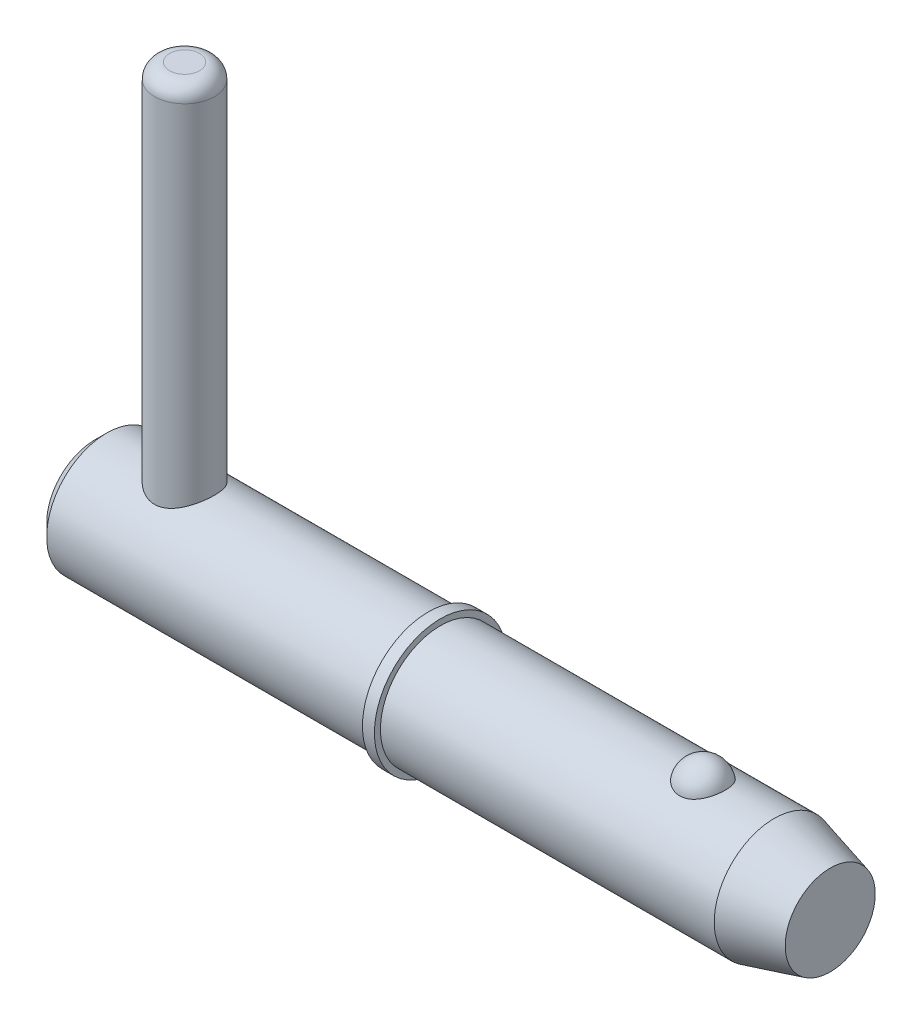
ISO-10303-21;
HEADER;
FILE_DESCRIPTION(('STEP AP214'),'2;1');
FILE_NAME('part.step','',(''),(''),'','','');
FILE_SCHEMA(('AUTOMOTIVE_DESIGN { 1 0 10303 214 1 1 1 1 }'));
ENDSEC;
DATA;
#1=APPLICATION_CONTEXT('core data for automotive mechanical design processes');
#2=APPLICATION_PROTOCOL_DEFINITION('international standard','automotive_design',2000,#1);
#3=PRODUCT_CONTEXT('',#1,'mechanical');
#4=PRODUCT('Part','Part','',(#3));
#5=PRODUCT_RELATED_PRODUCT_CATEGORY('part','',(#4));
#6=PRODUCT_DEFINITION_FORMATION('','',#4);
#7=PRODUCT_DEFINITION_CONTEXT('part definition',#1,'design');
#8=PRODUCT_DEFINITION('design','',#6,#7);
#9=PRODUCT_DEFINITION_SHAPE('','',#8);
#10=(LENGTH_UNIT() NAMED_UNIT(*) SI_UNIT(.MILLI.,.METRE.));
#11=(NAMED_UNIT(*) PLANE_ANGLE_UNIT() SI_UNIT($,.RADIAN.));
#12=(NAMED_UNIT(*) SI_UNIT($,.STERADIAN.) SOLID_ANGLE_UNIT());
#13=UNCERTAINTY_MEASURE_WITH_UNIT(LENGTH_MEASURE(1.E-05),#10,'distance_accuracy_value','');
#14=(GEOMETRIC_REPRESENTATION_CONTEXT(3) GLOBAL_UNCERTAINTY_ASSIGNED_CONTEXT((#13)) GLOBAL_UNIT_ASSIGNED_CONTEXT((#10,
#11,#12)) REPRESENTATION_CONTEXT('',''));
#15=CARTESIAN_POINT('',(0.,0.,0.));
#16=DIRECTION('',(0.,0.,1.));
#17=DIRECTION('',(1.,0.,0.));
#18=AXIS2_PLACEMENT_3D('',#15,#16,#17);
#19=CARTESIAN_POINT('',(4.755,22.225,0.));
#20=DIRECTION('',(0.,-1.,0.));
#21=DIRECTION('',(0.,0.,-1.));
#22=AXIS2_PLACEMENT_3D('',#19,#20,#21);
#23=CYLINDRICAL_SURFACE('',#22,1.585);
#24=CARTESIAN_POINT('',(4.755,-2.3825,0.));
#25=DIRECTION('',(0.,1.,0.));
#26=DIRECTION('',(0.,0.,1.));
#27=AXIS2_PLACEMENT_3D('',#24,#25,#26);
#28=CIRCLE('',#27,1.585);
#29=CARTESIAN_POINT('',(4.755,-2.3825,1.585));
#30=VERTEX_POINT('',#29);
#31=EDGE_CURVE('P0_E25',#30,#30,#28,.T.);
#32=ORIENTED_EDGE('',*,*,#31,.T.);
#33=EDGE_LOOP('',(#32));
#34=FACE_BOUND('',#33,.T.);
#35=CARTESIAN_POINT('',(4.755,21.4325,0.));
#36=DIRECTION('',(0.,1.,0.));
#37=DIRECTION('',(0.,0.,1.));
#38=AXIS2_PLACEMENT_3D('',#35,#36,#37);
#39=CIRCLE('',#38,1.585);
#40=CARTESIAN_POINT('',(4.755,21.4325,1.585));
#41=VERTEX_POINT('',#40);
#42=EDGE_CURVE('P0_E29',#41,#41,#39,.F.);
#43=ORIENTED_EDGE('',*,*,#42,.T.);
#44=EDGE_LOOP('',(#43));
#45=FACE_BOUND('',#44,.T.);
#46=ADVANCED_FACE('P0_F14',(#34,#45),#23,.T.);
#47=CARTESIAN_POINT('',(4.755,22.225,0.));
#48=DIRECTION('',(0.,1.,0.));
#49=DIRECTION('',(0.,0.,1.));
#50=AXIS2_PLACEMENT_3D('',#47,#48,#49);
#51=PLANE('',#50);
#52=CARTESIAN_POINT('',(4.755,22.225,0.));
#53=DIRECTION('',(0.,1.,0.));
#54=DIRECTION('',(0.,0.,1.));
#55=AXIS2_PLACEMENT_3D('',#52,#53,#54);
#56=CIRCLE('',#55,0.7925);
#57=CARTESIAN_POINT('',(4.755,22.225,0.7925));
#58=VERTEX_POINT('',#57);
#59=EDGE_CURVE('P0_E10',#58,#58,#56,.T.);
#60=ORIENTED_EDGE('',*,*,#59,.T.);
#61=EDGE_LOOP('',(#60));
#62=FACE_BOUND('',#61,.T.);
#63=ADVANCED_FACE('P0_F46',(#62),#51,.T.);
#64=CARTESIAN_POINT('',(4.755,-3.175,0.));
#65=DIRECTION('',(0.,1.,0.));
#66=DIRECTION('',(0.,0.,1.));
#67=AXIS2_PLACEMENT_3D('',#64,#65,#66);
#68=PLANE('',#67);
#69=CARTESIAN_POINT('',(4.755,-3.175,0.));
#70=DIRECTION('',(0.,1.,0.));
#71=DIRECTION('',(0.,0.,1.));
#72=AXIS2_PLACEMENT_3D('',#69,#70,#71);
#73=CIRCLE('',#72,0.7925);
#74=CARTESIAN_POINT('',(4.755,-3.175,0.7925));
#75=VERTEX_POINT('',#74);
#76=EDGE_CURVE('P0_E21',#75,#75,#73,.F.);
#77=ORIENTED_EDGE('',*,*,#76,.T.);
#78=EDGE_LOOP('',(#77));
#79=FACE_BOUND('',#78,.T.);
#80=ADVANCED_FACE('P0_F43',(#79),#68,.F.);
#81=CARTESIAN_POINT('',(4.755,-2.3825,0.));
#82=DIRECTION('',(0.,1.,0.));
#83=DIRECTION('',(0.,0.,1.));
#84=AXIS2_PLACEMENT_3D('',#81,#82,#83);
#85=DEGENERATE_TOROIDAL_SURFACE('',#84,0.7925,0.7925,.T.);
#86=ORIENTED_EDGE('',*,*,#76,.F.);
#87=EDGE_LOOP('',(#86));
#88=FACE_BOUND('',#87,.T.);
#89=ORIENTED_EDGE('',*,*,#31,.F.);
#90=EDGE_LOOP('',(#89));
#91=FACE_BOUND('',#90,.T.);
#92=ADVANCED_FACE('P0_F38',(#88,#91),#85,.T.);
#93=CARTESIAN_POINT('',(4.755,21.4325,0.));
#94=DIRECTION('',(0.,1.,0.));
#95=DIRECTION('',(0.,0.,1.));
#96=AXIS2_PLACEMENT_3D('',#93,#94,#95);
#97=DEGENERATE_TOROIDAL_SURFACE('',#96,0.7925,0.7925,.T.);
#98=ORIENTED_EDGE('',*,*,#42,.F.);
#99=EDGE_LOOP('',(#98));
#100=FACE_BOUND('',#99,.T.);
#101=ORIENTED_EDGE('',*,*,#59,.F.);
#102=EDGE_LOOP('',(#101));
#103=FACE_BOUND('',#102,.T.);
#104=ADVANCED_FACE('P0_F16',(#100,#103),#97,.T.);
#105=CLOSED_SHELL('',(#46,#63,#80,#92,#104));
#106=MANIFOLD_SOLID_BREP('P0_B1',#105);
#107=CARTESIAN_POINT('',(0.,0.,0.));
#108=DIRECTION('',(1.,0.,0.));
#109=DIRECTION('',(0.,0.,-1.));
#110=AXIS2_PLACEMENT_3D('',#107,#108,#109);
#111=CYLINDRICAL_SURFACE('',#110,3.175);
#112=CARTESIAN_POINT('',(35.9476846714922,0.,0.));
#113=DIRECTION('',(1.,0.,0.));
#114=DIRECTION('',(0.,0.,-1.));
#115=AXIS2_PLACEMENT_3D('',#112,#113,#114);
#116=CIRCLE('',#115,3.175);
#117=CARTESIAN_POINT('',(35.9476846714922,0.,-3.175));
#118=VERTEX_POINT('',#117);
#119=EDGE_CURVE('P1_E81',#118,#118,#116,.T.);
#120=ORIENTED_EDGE('',*,*,#119,.F.);
#121=EDGE_LOOP('',(#120));
#122=FACE_BOUND('',#121,.T.);
#123=CARTESIAN_POINT('',(18.29,0.,0.));
#124=DIRECTION('',(1.,0.,0.));
#125=DIRECTION('',(0.,0.,-1.));
#126=AXIS2_PLACEMENT_3D('',#123,#124,#125);
#127=CIRCLE('',#126,3.175);
#128=CARTESIAN_POINT('',(18.29,0.,-3.175));
#129=VERTEX_POINT('',#128);
#130=EDGE_CURVE('P1_E85',#129,#129,#127,.T.);
#131=ORIENTED_EDGE('',*,*,#130,.T.);
#132=EDGE_LOOP('',(#131));
#133=FACE_BOUND('',#132,.T.);
#134=CARTESIAN_POINT('',(32.1757276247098,2.92898950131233,1.2254164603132));
#135=CARTESIAN_POINT('',(32.112316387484,2.92899434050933,1.22541146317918));
#136=CARTESIAN_POINT('',(32.0487979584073,2.93112688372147,1.2203464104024));
#137=CARTESIAN_POINT('',(31.9235306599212,2.93942752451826,1.20020949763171));
#138=CARTESIAN_POINT('',(31.8617869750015,2.9456063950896,1.18511092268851));
#139=CARTESIAN_POINT('',(31.7420651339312,2.96127115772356,1.14540352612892));
#140=CARTESIAN_POINT('',(31.6840775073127,2.97074831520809,1.12081980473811));
#141=CARTESIAN_POINT('',(31.5731943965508,2.99197584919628,1.06285154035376));
#142=CARTESIAN_POINT('',(31.5202966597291,3.0037252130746,1.0294709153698));
#143=CARTESIAN_POINT('',(31.4192688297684,3.02865714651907,0.95367409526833));
#144=CARTESIAN_POINT('',(31.371324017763,3.04187163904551,0.911021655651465));
#145=CARTESIAN_POINT('',(31.2830360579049,3.06808741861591,0.818400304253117));
#146=CARTESIAN_POINT('',(31.2426952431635,3.08108863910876,0.768429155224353));
#147=CARTESIAN_POINT('',(31.1688039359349,3.10614903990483,0.660064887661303));
#148=CARTESIAN_POINT('',(31.1356330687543,3.11814104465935,0.601396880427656));
#149=CARTESIAN_POINT('',(31.0791190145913,3.13926931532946,0.479026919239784));
#150=CARTESIAN_POINT('',(31.0557764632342,3.14840539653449,0.415324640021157));
#151=CARTESIAN_POINT('',(31.0191785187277,3.16298160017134,0.283885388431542));
#152=CARTESIAN_POINT('',(31.0060407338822,3.16837855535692,0.216110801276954));
#153=CARTESIAN_POINT('',(30.9905676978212,3.17475386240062,0.0791367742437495));
#154=CARTESIAN_POINT('',(30.988232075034,3.17573236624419,0.00993738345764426));
#155=CARTESIAN_POINT('',(30.994388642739,3.17318075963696,-0.127420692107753));
#156=CARTESIAN_POINT('',(31.0028073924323,3.16968122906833,-0.195583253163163));
#157=CARTESIAN_POINT('',(31.0301752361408,3.1585790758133,-0.329413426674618));
#158=CARTESIAN_POINT('',(31.0491245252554,3.15097637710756,-0.395080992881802));
#159=CARTESIAN_POINT('',(31.0972057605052,3.13242485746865,-0.522180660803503));
#160=CARTESIAN_POINT('',(31.1263524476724,3.12147119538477,-0.583606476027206));
#161=CARTESIAN_POINT('',(31.1942352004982,3.09734973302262,-0.700436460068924));
#162=CARTESIAN_POINT('',(31.232972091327,3.08418174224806,-0.755840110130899));
#163=CARTESIAN_POINT('',(31.3194771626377,3.05694884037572,-0.859404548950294));
#164=CARTESIAN_POINT('',(31.3672961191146,3.04287919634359,-0.907521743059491));
#165=CARTESIAN_POINT('',(31.4707353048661,3.01548927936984,-0.994758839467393));
#166=CARTESIAN_POINT('',(31.5263549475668,3.00216895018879,-1.03387941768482));
#167=CARTESIAN_POINT('',(31.6428093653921,2.97810316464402,-1.10126594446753));
#168=CARTESIAN_POINT('',(31.7035182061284,2.96731170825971,-1.12973256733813));
#169=CARTESIAN_POINT('',(31.8293712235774,2.9492893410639,-1.17598467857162));
#170=CARTESIAN_POINT('',(31.8945137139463,2.94205708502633,-1.19377420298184));
#171=CARTESIAN_POINT('',(32.0238562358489,2.93233065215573,-1.21746387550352));
#172=CARTESIAN_POINT('',(32.0879385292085,2.92961621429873,-1.22391763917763));
#173=CARTESIAN_POINT('',(32.2163375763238,2.92855752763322,-1.22644976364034));
#174=CARTESIAN_POINT('',(32.2806542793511,2.93021238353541,-1.22253024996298));
#175=CARTESIAN_POINT('',(32.4055239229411,2.9375685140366,-1.20474140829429));
#176=CARTESIAN_POINT('',(32.466131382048,2.94313790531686,-1.19119621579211));
#177=CARTESIAN_POINT('',(32.5841106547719,2.95756226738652,-1.15491492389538));
#178=CARTESIAN_POINT('',(32.6414822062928,2.96641750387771,-1.13217808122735));
#179=CARTESIAN_POINT('',(32.7527699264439,2.98669918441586,-1.07755083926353));
#180=CARTESIAN_POINT('',(32.8065845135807,2.9981771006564,-1.0454730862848));
#181=CARTESIAN_POINT('',(32.9081473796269,3.02240235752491,-0.973220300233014));
#182=CARTESIAN_POINT('',(32.9558942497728,3.03514999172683,-0.933043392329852));
#183=CARTESIAN_POINT('',(33.0465817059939,3.06131230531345,-0.843372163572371));
#184=CARTESIAN_POINT('',(33.0891588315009,3.07472822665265,-0.793510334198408));
#185=CARTESIAN_POINT('',(33.1656765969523,3.10021106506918,-0.687241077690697));
#186=CARTESIAN_POINT('',(33.1996156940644,3.1122777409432,-0.630832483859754));
#187=CARTESIAN_POINT('',(33.2591209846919,3.134208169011,-0.511059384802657));
#188=CARTESIAN_POINT('',(33.2843892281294,3.14399040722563,-0.447531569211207));
#189=CARTESIAN_POINT('',(33.3245117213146,3.15983820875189,-0.316827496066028));
#190=CARTESIAN_POINT('',(33.3393659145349,3.16590375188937,-0.249651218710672));
#191=CARTESIAN_POINT('',(33.358358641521,3.17370076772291,-0.11354918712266));
#192=CARTESIAN_POINT('',(33.3624966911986,3.17543204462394,-0.0446233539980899));
#193=CARTESIAN_POINT('',(33.3599697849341,3.17438372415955,0.0929938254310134));
#194=CARTESIAN_POINT('',(33.3533050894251,3.17160423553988,0.161685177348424));
#195=CARTESIAN_POINT('',(33.3293754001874,3.1618438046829,0.296502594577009));
#196=CARTESIAN_POINT('',(33.3121674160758,3.15488546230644,0.362640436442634));
#197=CARTESIAN_POINT('',(33.267547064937,3.13748892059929,0.490896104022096));
#198=CARTESIAN_POINT('',(33.2401339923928,3.12705048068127,0.553013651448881));
#199=CARTESIAN_POINT('',(33.1754626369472,3.10369139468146,0.671876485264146));
#200=CARTESIAN_POINT('',(33.1381467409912,3.0907563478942,0.728587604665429));
#201=CARTESIAN_POINT('',(33.0545246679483,3.06381731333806,0.834653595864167));
#202=CARTESIAN_POINT('',(33.0082189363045,3.04981337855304,0.884008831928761));
#203=CARTESIAN_POINT('',(32.9077184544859,3.02230423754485,0.973916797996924));
#204=CARTESIAN_POINT('',(32.853535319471,3.00879833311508,1.01448227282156));
#205=CARTESIAN_POINT('',(32.7385299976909,2.98383625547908,1.0857155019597));
#206=CARTESIAN_POINT('',(32.6777053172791,2.9723808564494,1.11637952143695));
#207=CARTESIAN_POINT('',(32.5533690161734,2.95329063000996,1.16592590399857));
#208=CARTESIAN_POINT('',(32.4900230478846,2.9455373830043,1.18517901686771));
#209=CARTESIAN_POINT('',(32.3607664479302,2.9342556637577,1.21284802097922));
#210=CARTESIAN_POINT('',(32.2948641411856,2.93071450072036,1.2212964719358));
#211=CARTESIAN_POINT('',(32.211116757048,2.9291525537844,1.22502505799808));
#212=CARTESIAN_POINT('',(32.1934263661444,2.92898815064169,1.22541785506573));
#213=CARTESIAN_POINT('',(32.1757276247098,2.92898950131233,1.2254164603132));
#214=B_SPLINE_CURVE_WITH_KNOTS('',3,(#134,#135,#136,#137,#138,#139,#140,#141,#142,#143,#144,
#145,#146,#147,#148,#149,#150,#151,#152,#153,#154,#155,#156,#157,#158,#159,#160,#161,#162,#163,
#164,#165,#166,#167,#168,#169,#170,#171,#172,#173,#174,#175,#176,#177,#178,#179,#180,#181,#182,
#183,#184,#185,#186,#187,#188,#189,#190,#191,#192,#193,#194,#195,#196,#197,#198,#199,#200,#201,
#202,#203,#204,#205,#206,#207,#208,#209,#210,#211,#212,#213),.UNSPECIFIED.,.T.,.F.,(4,2,2,2,2,2,
2,2,2,2,2,2,2,2,2,2,2,2,2,2,2,2,2,2,2,2,2,2,2,2,2,2,2,2,2,2,2,2,2,4),(0.,0.190186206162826,
0.380880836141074,0.571074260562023,0.761183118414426,0.956866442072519,1.1526097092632,
1.3570177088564,1.56143892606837,1.76818248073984,1.97491892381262,2.18025109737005,
2.38558707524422,2.59122111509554,2.79687285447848,3.00371012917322,3.2105318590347,
3.41323429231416,3.61586005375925,3.80828192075,4.00066436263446,4.18685798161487,
4.37306665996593,4.56330302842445,4.75358348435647,4.95345287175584,5.15335793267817,
5.35957003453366,5.56578325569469,5.77200579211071,5.97822335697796,6.183335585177,
6.38846199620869,6.59480900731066,6.80114579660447,7.00718137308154,7.21329457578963,
7.41228022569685,7.61066481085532,7.66374777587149),.UNSPECIFIED.);
#215=CARTESIAN_POINT('',(32.1757276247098,2.92898950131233,1.2254164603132));
#216=VERTEX_POINT('',#215);
#217=EDGE_CURVE('P1_E35',#216,#216,#214,.T.);
#218=ORIENTED_EDGE('',*,*,#217,.T.);
#219=EDGE_LOOP('',(#218));
#220=FACE_BOUND('',#219,.T.);
#221=ADVANCED_FACE('P1_F13',(#122,#133,#220),#111,.T.);
#222=CARTESIAN_POINT('',(0.,0.,0.));
#223=DIRECTION('',(-1.,0.,0.));
#224=DIRECTION('',(0.,0.,1.));
#225=AXIS2_PLACEMENT_3D('',#222,#223,#224);
#226=PLANE('',#225);
#227=CARTESIAN_POINT('',(0.,0.,0.));
#228=DIRECTION('',(1.,0.,0.));
#229=DIRECTION('',(0.,0.,-1.));
#230=AXIS2_PLACEMENT_3D('',#227,#228,#229);
#231=CIRCLE('',#230,2.54);
#232=CARTESIAN_POINT('',(0.,0.,-2.54));
#233=VERTEX_POINT('',#232);
#234=EDGE_CURVE('P1_E9',#233,#233,#231,.T.);
#235=ORIENTED_EDGE('',*,*,#234,.F.);
#236=EDGE_LOOP('',(#235));
#237=FACE_BOUND('',#236,.T.);
#238=ADVANCED_FACE('P1_F15',(#237),#226,.T.);
#239=CARTESIAN_POINT('',(0.634999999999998,0.,0.));
#240=DIRECTION('',(1.,0.,0.));
#241=DIRECTION('',(0.,0.,-1.));
#242=AXIS2_PLACEMENT_3D('',#239,#240,#241);
#243=CONICAL_SURFACE('',#242,3.175,0.78539816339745);
#244=ORIENTED_EDGE('',*,*,#234,.T.);
#245=EDGE_LOOP('',(#244));
#246=FACE_BOUND('',#245,.T.);
#247=CARTESIAN_POINT('',(0.634999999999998,0.,0.));
#248=DIRECTION('',(1.,0.,0.));
#249=DIRECTION('',(0.,0.,-1.));
#250=AXIS2_PLACEMENT_3D('',#247,#248,#249);
#251=CIRCLE('',#250,3.175);
#252=CARTESIAN_POINT('',(0.634999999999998,0.,-3.175));
#253=VERTEX_POINT('',#252);
#254=EDGE_CURVE('P1_E26',#253,#253,#251,.T.);
#255=ORIENTED_EDGE('',*,*,#254,.F.);
#256=EDGE_LOOP('',(#255));
#257=FACE_BOUND('',#256,.T.);
#258=ADVANCED_FACE('P1_F77',(#246,#257),#243,.T.);
#259=CARTESIAN_POINT('',(0.,0.,0.));
#260=DIRECTION('',(1.,0.,0.));
#261=DIRECTION('',(0.,0.,-1.));
#262=AXIS2_PLACEMENT_3D('',#259,#260,#261);
#263=CYLINDRICAL_SURFACE('',#262,3.175);
#264=CARTESIAN_POINT('',(4.755,-2.75107251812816,1.585));
#265=CARTESIAN_POINT('',(4.67238891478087,-2.7510796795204,1.58499425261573));
#266=CARTESIAN_POINT('',(4.58967306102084,-2.75485010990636,1.57849830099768));
#267=CARTESIAN_POINT('',(4.42677850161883,-2.76938647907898,1.55284486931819));
#268=CARTESIAN_POINT('',(4.34660551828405,-2.78016716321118,1.53366069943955));
#269=CARTESIAN_POINT('',(4.19146029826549,-2.80716278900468,1.48366329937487));
#270=CARTESIAN_POINT('',(4.11646293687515,-2.8233488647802,1.45291173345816));
#271=CARTESIAN_POINT('',(3.97271079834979,-2.85928672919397,1.38084067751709));
#272=CARTESIAN_POINT('',(3.90395634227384,-2.87903870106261,1.33952064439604));
#273=CARTESIAN_POINT('',(3.76839976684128,-2.921867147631,1.24350234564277));
#274=CARTESIAN_POINT('',(3.702222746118,-2.94508343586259,1.18798355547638));
#275=CARTESIAN_POINT('',(3.5796334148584,-2.99109588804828,1.06685014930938));
#276=CARTESIAN_POINT('',(3.52322596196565,-3.01389183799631,1.00123054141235));
#277=CARTESIAN_POINT('',(3.41807024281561,-3.05832598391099,0.856373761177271));
#278=CARTESIAN_POINT('',(3.37009053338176,-3.07978367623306,0.776518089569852));
#279=CARTESIAN_POINT('',(3.28853137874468,-3.11730894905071,0.608596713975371));
#280=CARTESIAN_POINT('',(3.25494287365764,-3.1333799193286,0.520536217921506));
#281=CARTESIAN_POINT('',(3.20559401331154,-3.15731341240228,0.345327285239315));
#282=CARTESIAN_POINT('',(3.18873760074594,-3.16567752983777,0.258557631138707));
#283=CARTESIAN_POINT('',(3.16972238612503,-3.17512718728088,0.0830496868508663));
#284=CARTESIAN_POINT('',(3.16755472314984,-3.17621711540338,-0.00568738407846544));
#285=CARTESIAN_POINT('',(3.1775542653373,-3.17123385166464,-0.174372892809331));
#286=CARTESIAN_POINT('',(3.18849502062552,-3.16577346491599,-0.254416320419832));
#287=CARTESIAN_POINT('',(3.22220680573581,-3.14922844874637,-0.411354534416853));
#288=CARTESIAN_POINT('',(3.2449787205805,-3.13814339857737,-0.488249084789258));
#289=CARTESIAN_POINT('',(3.30185558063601,-3.111172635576,-0.638050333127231));
#290=CARTESIAN_POINT('',(3.33611332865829,-3.09522247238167,-0.710886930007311));
#291=CARTESIAN_POINT('',(3.41477890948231,-3.05996035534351,-0.849953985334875));
#292=CARTESIAN_POINT('',(3.45919037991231,-3.04064719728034,-0.916182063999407));
#293=CARTESIAN_POINT('',(3.5617148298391,-2.99832415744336,-1.04681642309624));
#294=CARTESIAN_POINT('',(3.62072497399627,-2.97513741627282,-1.11046186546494));
#295=CARTESIAN_POINT('',(3.7483697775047,-2.92885066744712,-1.22736291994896));
#296=CARTESIAN_POINT('',(3.81701173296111,-2.90575073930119,-1.2806105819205));
#297=CARTESIAN_POINT('',(3.96727993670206,-2.86067370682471,-1.37849835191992));
#298=CARTESIAN_POINT('',(4.04945242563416,-2.83885964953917,-1.42238246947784));
#299=CARTESIAN_POINT('',(4.2213558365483,-2.80110454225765,-1.49537418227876));
#300=CARTESIAN_POINT('',(4.3110787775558,-2.78515738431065,-1.52449715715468));
#301=CARTESIAN_POINT('',(4.48806324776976,-2.76271292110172,-1.56478065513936));
#302=CARTESIAN_POINT('',(4.57495732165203,-2.75556745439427,-1.57718067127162));
#303=CARTESIAN_POINT('',(4.74985771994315,-2.74969306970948,-1.58740564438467));
#304=CARTESIAN_POINT('',(4.8378632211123,-2.75095824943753,-1.58524082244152));
#305=CARTESIAN_POINT('',(5.00227282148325,-2.76107477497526,-1.56753530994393));
#306=CARTESIAN_POINT('',(5.07889680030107,-2.76908515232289,-1.55347662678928));
#307=CARTESIAN_POINT('',(5.22855309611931,-2.79054849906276,-1.51458035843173));
#308=CARTESIAN_POINT('',(5.30158424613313,-2.80400322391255,-1.489739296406));
#309=CARTESIAN_POINT('',(5.44583114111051,-2.83556995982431,-1.42877335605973));
#310=CARTESIAN_POINT('',(5.51680600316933,-2.85386886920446,-1.39217900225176));
#311=CARTESIAN_POINT('',(5.6520174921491,-2.89289503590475,-1.30915485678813));
#312=CARTESIAN_POINT('',(5.71625063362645,-2.91362353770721,-1.26272001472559));
#313=CARTESIAN_POINT('',(5.8445938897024,-2.95830220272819,-1.15451693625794));
#314=CARTESIAN_POINT('',(5.90767560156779,-2.98233004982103,-1.09155543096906));
#315=CARTESIAN_POINT('',(6.0226995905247,-3.02864458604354,-0.955560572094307));
#316=CARTESIAN_POINT('',(6.07463814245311,-3.05093069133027,-0.882523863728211));
#317=CARTESIAN_POINT('',(6.16704288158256,-3.09200671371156,-0.725836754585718));
#318=CARTESIAN_POINT('',(6.20717458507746,-3.11069030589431,-0.64195924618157));
#319=CARTESIAN_POINT('',(6.27235859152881,-3.1416474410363,-0.467442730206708));
#320=CARTESIAN_POINT('',(6.29742409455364,-3.15392659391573,-0.376809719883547));
#321=CARTESIAN_POINT('',(6.32960989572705,-3.16979844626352,-0.200314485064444));
#322=CARTESIAN_POINT('',(6.33816324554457,-3.17408359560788,-0.114775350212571));
#323=CARTESIAN_POINT('',(6.34130309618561,-3.17565001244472,0.0566108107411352));
#324=CARTESIAN_POINT('',(6.33589445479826,-3.17293371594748,0.142457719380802));
#325=CARTESIAN_POINT('',(6.31221457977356,-3.16120608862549,0.306097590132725));
#326=CARTESIAN_POINT('',(6.2948097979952,-3.15261910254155,0.38404960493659));
#327=CARTESIAN_POINT('',(6.24879775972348,-3.13040364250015,0.535801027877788));
#328=CARTESIAN_POINT('',(6.22018889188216,-3.11677444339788,0.609599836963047));
#329=CARTESIAN_POINT('',(6.15130303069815,-3.08497808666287,0.754502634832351));
#330=CARTESIAN_POINT('',(6.11057850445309,-3.0666414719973,0.82535556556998));
#331=CARTESIAN_POINT('',(6.01917980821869,-3.02735012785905,0.95951596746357));
#332=CARTESIAN_POINT('',(5.96850106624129,-3.00639419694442,1.02281994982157));
#333=CARTESIAN_POINT('',(5.8528006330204,-2.96149402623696,1.1467073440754));
#334=CARTESIAN_POINT('',(5.78685463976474,-2.93745961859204,1.20639723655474));
#335=CARTESIAN_POINT('',(5.64552278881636,-2.89084502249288,1.31419099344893));
#336=CARTESIAN_POINT('',(5.57012871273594,-2.8682661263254,1.36228466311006));
#337=CARTESIAN_POINT('',(5.40892145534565,-2.82661780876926,1.44677201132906));
#338=CARTESIAN_POINT('',(5.32285703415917,-2.80767948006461,1.48275497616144));
#339=CARTESIAN_POINT('',(5.14469010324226,-2.77716572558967,1.53916557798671));
#340=CARTESIAN_POINT('',(5.05260892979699,-2.76556569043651,1.55964525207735));
#341=CARTESIAN_POINT('',(4.92544162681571,-2.75613775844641,1.57618070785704));
#342=CARTESIAN_POINT('',(4.89147210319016,-2.75424493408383,1.57948285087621));
#343=CARTESIAN_POINT('',(4.82334103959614,-2.75171079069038,1.58389375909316));
#344=CARTESIAN_POINT('',(4.78917948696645,-2.75106955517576,1.58500237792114));
#345=CARTESIAN_POINT('',(4.755,-2.75107251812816,1.585));
#346=B_SPLINE_CURVE_WITH_KNOTS('',3,(#264,#265,#266,#267,#268,#269,#270,#271,#272,#273,#274,
#275,#276,#277,#278,#279,#280,#281,#282,#283,#284,#285,#286,#287,#288,#289,#290,#291,#292,#293,
#294,#295,#296,#297,#298,#299,#300,#301,#302,#303,#304,#305,#306,#307,#308,#309,#310,#311,#312,
#313,#314,#315,#316,#317,#318,#319,#320,#321,#322,#323,#324,#325,#326,#327,#328,#329,#330,#331,
#332,#333,#334,#335,#336,#337,#338,#339,#340,#341,#342,#343,#344,#345),.UNSPECIFIED.,.T.,.F.,(4,
2,2,2,2,2,2,2,2,2,2,2,2,2,2,2,2,2,2,2,2,2,2,2,2,2,2,2,2,2,2,2,2,2,2,2,2,2,2,2,4),(0.,
0.247689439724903,0.495901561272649,0.742808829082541,0.989728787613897,1.25694656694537,
1.52429683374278,1.80959781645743,2.0947189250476,2.35960564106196,2.62433255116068,
2.86610932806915,3.1079041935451,3.35305262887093,3.59828902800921,3.86665310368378,
4.13522157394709,4.4207514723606,4.70598326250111,4.9686344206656,5.23110127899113,
5.46499114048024,5.69895647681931,5.94376186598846,6.1886932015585,6.46438263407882,
6.74016408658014,7.0231370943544,7.30586181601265,7.5626977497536,7.81944433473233,
8.05935987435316,8.29930993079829,8.54954401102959,8.79989329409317,9.07508848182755,
9.35052473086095,9.63453318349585,9.91758407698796,10.0200561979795,10.1225351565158),.UNSPECIFIED.);
#347=CARTESIAN_POINT('',(4.755,-2.75107251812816,1.585));
#348=VERTEX_POINT('',#347);
#349=EDGE_CURVE('P1_E17',#348,#348,#346,.T.);
#350=ORIENTED_EDGE('',*,*,#349,.F.);
#351=EDGE_LOOP('',(#350));
#352=FACE_BOUND('',#351,.T.);
#353=CARTESIAN_POINT('',(4.755,2.75107251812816,1.585));
#354=CARTESIAN_POINT('',(4.83761108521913,2.7510796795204,1.58499425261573));
#355=CARTESIAN_POINT('',(4.92032693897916,2.75485010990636,1.57849830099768));
#356=CARTESIAN_POINT('',(5.08322149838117,2.76938647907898,1.55284486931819));
#357=CARTESIAN_POINT('',(5.16339448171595,2.78016716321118,1.53366069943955));
#358=CARTESIAN_POINT('',(5.31853970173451,2.80716278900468,1.48366329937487));
#359=CARTESIAN_POINT('',(5.39353706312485,2.8233488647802,1.45291173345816));
#360=CARTESIAN_POINT('',(5.53728920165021,2.85928672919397,1.38084067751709));
#361=CARTESIAN_POINT('',(5.60604365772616,2.87903870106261,1.33952064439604));
#362=CARTESIAN_POINT('',(5.74160023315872,2.921867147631,1.24350234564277));
#363=CARTESIAN_POINT('',(5.807777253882,2.94508343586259,1.18798355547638));
#364=CARTESIAN_POINT('',(5.9303665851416,2.99109588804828,1.06685014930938));
#365=CARTESIAN_POINT('',(5.98677403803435,3.01389183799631,1.00123054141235));
#366=CARTESIAN_POINT('',(6.09192975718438,3.05832598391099,0.85637376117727));
#367=CARTESIAN_POINT('',(6.13990946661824,3.07978367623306,0.776518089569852));
#368=CARTESIAN_POINT('',(6.22146862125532,3.11730894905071,0.608596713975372));
#369=CARTESIAN_POINT('',(6.25505712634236,3.1333799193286,0.520536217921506));
#370=CARTESIAN_POINT('',(6.30440598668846,3.15731341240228,0.345327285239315));
#371=CARTESIAN_POINT('',(6.32126239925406,3.16567752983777,0.258557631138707));
#372=CARTESIAN_POINT('',(6.34027761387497,3.17512718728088,0.0830496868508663));
#373=CARTESIAN_POINT('',(6.34244527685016,3.17621711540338,-0.00568738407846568));
#374=CARTESIAN_POINT('',(6.3324457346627,3.17123385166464,-0.174372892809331));
#375=CARTESIAN_POINT('',(6.32150497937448,3.16577346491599,-0.254416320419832));
#376=CARTESIAN_POINT('',(6.28779319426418,3.14922844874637,-0.411354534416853));
#377=CARTESIAN_POINT('',(6.2650212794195,3.13814339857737,-0.488249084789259));
#378=CARTESIAN_POINT('',(6.20814441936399,3.111172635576,-0.638050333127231));
#379=CARTESIAN_POINT('',(6.17388667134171,3.09522247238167,-0.710886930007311));
#380=CARTESIAN_POINT('',(6.09522109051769,3.05996035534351,-0.849953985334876));
#381=CARTESIAN_POINT('',(6.05080962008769,3.04064719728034,-0.916182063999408));
#382=CARTESIAN_POINT('',(5.9482851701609,2.99832415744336,-1.04681642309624));
#383=CARTESIAN_POINT('',(5.88927502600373,2.97513741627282,-1.11046186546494));
#384=CARTESIAN_POINT('',(5.7616302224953,2.92885066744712,-1.22736291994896));
#385=CARTESIAN_POINT('',(5.69298826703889,2.90575073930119,-1.2806105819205));
#386=CARTESIAN_POINT('',(5.54272006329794,2.86067370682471,-1.37849835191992));
#387=CARTESIAN_POINT('',(5.46054757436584,2.83885964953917,-1.42238246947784));
#388=CARTESIAN_POINT('',(5.2886441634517,2.80110454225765,-1.49537418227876));
#389=CARTESIAN_POINT('',(5.19892122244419,2.78515738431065,-1.52449715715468));
#390=CARTESIAN_POINT('',(5.02193675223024,2.76271292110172,-1.56478065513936));
#391=CARTESIAN_POINT('',(4.93504267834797,2.75556745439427,-1.57718067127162));
#392=CARTESIAN_POINT('',(4.76014228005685,2.74969306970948,-1.58740564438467));
#393=CARTESIAN_POINT('',(4.6721367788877,2.75095824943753,-1.58524082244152));
#394=CARTESIAN_POINT('',(4.50772717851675,2.76107477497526,-1.56753530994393));
#395=CARTESIAN_POINT('',(4.43110319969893,2.76908515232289,-1.55347662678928));
#396=CARTESIAN_POINT('',(4.28144690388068,2.79054849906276,-1.51458035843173));
#397=CARTESIAN_POINT('',(4.20841575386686,2.80400322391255,-1.489739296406));
#398=CARTESIAN_POINT('',(4.06416885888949,2.83556995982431,-1.42877335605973));
#399=CARTESIAN_POINT('',(3.99319399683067,2.85386886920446,-1.39217900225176));
#400=CARTESIAN_POINT('',(3.8579825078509,2.89289503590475,-1.30915485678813));
#401=CARTESIAN_POINT('',(3.79374936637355,2.91362353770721,-1.26272001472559));
#402=CARTESIAN_POINT('',(3.6654061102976,2.95830220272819,-1.15451693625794));
#403=CARTESIAN_POINT('',(3.60232439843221,2.98233004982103,-1.09155543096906));
#404=CARTESIAN_POINT('',(3.4873004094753,3.02864458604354,-0.955560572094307));
#405=CARTESIAN_POINT('',(3.43536185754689,3.05093069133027,-0.88252386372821));
#406=CARTESIAN_POINT('',(3.34295711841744,3.09200671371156,-0.725836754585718));
#407=CARTESIAN_POINT('',(3.30282541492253,3.11069030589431,-0.64195924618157));
#408=CARTESIAN_POINT('',(3.23764140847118,3.14164744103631,-0.467442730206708));
#409=CARTESIAN_POINT('',(3.21257590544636,3.15392659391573,-0.376809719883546));
#410=CARTESIAN_POINT('',(3.18039010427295,3.16979844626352,-0.200314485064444));
#411=CARTESIAN_POINT('',(3.17183675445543,3.17408359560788,-0.114775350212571));
#412=CARTESIAN_POINT('',(3.16869690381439,3.17565001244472,0.0566108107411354));
#413=CARTESIAN_POINT('',(3.17410554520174,3.17293371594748,0.142457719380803));
#414=CARTESIAN_POINT('',(3.19778542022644,3.16120608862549,0.306097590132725));
#415=CARTESIAN_POINT('',(3.2151902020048,3.15261910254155,0.384049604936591));
#416=CARTESIAN_POINT('',(3.26120224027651,3.13040364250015,0.535801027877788));
#417=CARTESIAN_POINT('',(3.28981110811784,3.11677444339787,0.609599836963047));
#418=CARTESIAN_POINT('',(3.35869696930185,3.08497808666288,0.754502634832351));
#419=CARTESIAN_POINT('',(3.39942149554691,3.0666414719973,0.82535556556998));
#420=CARTESIAN_POINT('',(3.49082019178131,3.02735012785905,0.95951596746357));
#421=CARTESIAN_POINT('',(3.54149893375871,3.00639419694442,1.02281994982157));
#422=CARTESIAN_POINT('',(3.6571993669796,2.96149402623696,1.1467073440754));
#423=CARTESIAN_POINT('',(3.72314536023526,2.93745961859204,1.20639723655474));
#424=CARTESIAN_POINT('',(3.86447721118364,2.89084502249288,1.31419099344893));
#425=CARTESIAN_POINT('',(3.93987128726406,2.8682661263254,1.36228466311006));
#426=CARTESIAN_POINT('',(4.10107854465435,2.82661780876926,1.44677201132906));
#427=CARTESIAN_POINT('',(4.18714296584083,2.80767948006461,1.48275497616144));
#428=CARTESIAN_POINT('',(4.36530989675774,2.77716572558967,1.53916557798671));
#429=CARTESIAN_POINT('',(4.45739107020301,2.76556569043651,1.55964525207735));
#430=CARTESIAN_POINT('',(4.58455837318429,2.75613775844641,1.57618070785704));
#431=CARTESIAN_POINT('',(4.61852789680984,2.75424493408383,1.57948285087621));
#432=CARTESIAN_POINT('',(4.68665896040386,2.75171079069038,1.58389375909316));
#433=CARTESIAN_POINT('',(4.72082051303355,2.75106955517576,1.58500237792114));
#434=CARTESIAN_POINT('',(4.755,2.75107251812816,1.585));
#435=B_SPLINE_CURVE_WITH_KNOTS('',3,(#353,#354,#355,#356,#357,#358,#359,#360,#361,#362,#363,
#364,#365,#366,#367,#368,#369,#370,#371,#372,#373,#374,#375,#376,#377,#378,#379,#380,#381,#382,
#383,#384,#385,#386,#387,#388,#389,#390,#391,#392,#393,#394,#395,#396,#397,#398,#399,#400,#401,
#402,#403,#404,#405,#406,#407,#408,#409,#410,#411,#412,#413,#414,#415,#416,#417,#418,#419,#420,
#421,#422,#423,#424,#425,#426,#427,#428,#429,#430,#431,#432,#433,#434),.UNSPECIFIED.,.T.,.F.,(4,
2,2,2,2,2,2,2,2,2,2,2,2,2,2,2,2,2,2,2,2,2,2,2,2,2,2,2,2,2,2,2,2,2,2,2,2,2,2,2,4),(0.,
0.247689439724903,0.495901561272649,0.742808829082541,0.989728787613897,1.25694656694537,
1.52429683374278,1.80959781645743,2.0947189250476,2.35960564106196,2.62433255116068,
2.86610932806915,3.1079041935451,3.35305262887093,3.59828902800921,3.86665310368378,
4.13522157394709,4.4207514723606,4.70598326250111,4.9686344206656,5.23110127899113,
5.46499114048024,5.69895647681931,5.94376186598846,6.1886932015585,6.46438263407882,
6.74016408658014,7.0231370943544,7.30586181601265,7.5626977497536,7.81944433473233,
8.05935987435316,8.29930993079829,8.54954401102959,8.79989329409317,9.07508848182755,
9.35052473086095,9.63453318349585,9.91758407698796,10.0200561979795,10.1225351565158),.UNSPECIFIED.);
#436=CARTESIAN_POINT('',(4.755,2.75107251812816,1.585));
#437=VERTEX_POINT('',#436);
#438=EDGE_CURVE('P1_E43',#437,#437,#435,.T.);
#439=ORIENTED_EDGE('',*,*,#438,.F.);
#440=EDGE_LOOP('',(#439));
#441=FACE_BOUND('',#440,.T.);
#442=ORIENTED_EDGE('',*,*,#254,.T.);
#443=EDGE_LOOP('',(#442));
#444=FACE_BOUND('',#443,.T.);
#445=CARTESIAN_POINT('',(17.655,0.,0.));
#446=DIRECTION('',(1.,0.,0.));
#447=DIRECTION('',(0.,0.,-1.));
#448=AXIS2_PLACEMENT_3D('',#445,#446,#447);
#449=CIRCLE('',#448,3.175);
#450=CARTESIAN_POINT('',(17.655,0.,-3.175));
#451=VERTEX_POINT('',#450);
#452=EDGE_CURVE('P1_E31',#451,#451,#449,.T.);
#453=ORIENTED_EDGE('',*,*,#452,.F.);
#454=EDGE_LOOP('',(#453));
#455=FACE_BOUND('',#454,.T.);
#456=ADVANCED_FACE('P1_F103',(#352,#441,#444,#455),#263,.T.);
#457=CARTESIAN_POINT('',(17.655,3.175,0.));
#458=DIRECTION('',(-1.,0.,0.));
#459=DIRECTION('',(0.,0.,1.));
#460=AXIS2_PLACEMENT_3D('',#457,#458,#459);
#461=PLANE('',#460);
#462=ORIENTED_EDGE('',*,*,#452,.T.);
#463=EDGE_LOOP('',(#462));
#464=FACE_BOUND('',#463,.T.);
#465=CARTESIAN_POINT('',(17.655,0.,0.));
#466=DIRECTION('',(1.,0.,0.));
#467=DIRECTION('',(0.,0.,-1.));
#468=AXIS2_PLACEMENT_3D('',#465,#466,#467);
#469=CIRCLE('',#468,3.4925);
#470=CARTESIAN_POINT('',(17.655,0.,-3.4925));
#471=VERTEX_POINT('',#470);
#472=EDGE_CURVE('P1_E91',#471,#471,#469,.T.);
#473=ORIENTED_EDGE('',*,*,#472,.F.);
#474=EDGE_LOOP('',(#473));
#475=FACE_BOUND('',#474,.T.);
#476=ADVANCED_FACE('P1_F100',(#464,#475),#461,.T.);
#477=CARTESIAN_POINT('',(0.,0.,0.));
#478=DIRECTION('',(1.,0.,0.));
#479=DIRECTION('',(0.,0.,-1.));
#480=AXIS2_PLACEMENT_3D('',#477,#478,#479);
#481=CYLINDRICAL_SURFACE('',#480,3.4925);
#482=ORIENTED_EDGE('',*,*,#472,.T.);
#483=EDGE_LOOP('',(#482));
#484=FACE_BOUND('',#483,.T.);
#485=CARTESIAN_POINT('',(18.29,0.,0.));
#486=DIRECTION('',(1.,0.,0.));
#487=DIRECTION('',(0.,0.,-1.));
#488=AXIS2_PLACEMENT_3D('',#485,#486,#487);
#489=CIRCLE('',#488,3.4925);
#490=CARTESIAN_POINT('',(18.29,0.,-3.4925));
#491=VERTEX_POINT('',#490);
#492=EDGE_CURVE('P1_E88',#491,#491,#489,.T.);
#493=ORIENTED_EDGE('',*,*,#492,.F.);
#494=EDGE_LOOP('',(#493));
#495=FACE_BOUND('',#494,.T.);
#496=ADVANCED_FACE('P1_F68',(#484,#495),#481,.T.);
#497=CARTESIAN_POINT('',(18.29,3.4925,0.));
#498=DIRECTION('',(1.,0.,0.));
#499=DIRECTION('',(0.,0.,-1.));
#500=AXIS2_PLACEMENT_3D('',#497,#498,#499);
#501=PLANE('',#500);
#502=ORIENTED_EDGE('',*,*,#492,.T.);
#503=EDGE_LOOP('',(#502));
#504=FACE_BOUND('',#503,.T.);
#505=ORIENTED_EDGE('',*,*,#130,.F.);
#506=EDGE_LOOP('',(#505));
#507=FACE_BOUND('',#506,.T.);
#508=ADVANCED_FACE('P1_F62',(#504,#507),#501,.T.);
#509=CARTESIAN_POINT('',(38.91,0.,0.));
#510=DIRECTION('',(-1.,0.,0.));
#511=DIRECTION('',(0.,0.,1.));
#512=AXIS2_PLACEMENT_3D('',#509,#510,#511);
#513=CONICAL_SURFACE('',#512,2.38125,0.261799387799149);
#514=ORIENTED_EDGE('',*,*,#119,.T.);
#515=EDGE_LOOP('',(#514));
#516=FACE_BOUND('',#515,.T.);
#517=CARTESIAN_POINT('',(38.91,0.,0.));
#518=DIRECTION('',(1.,0.,0.));
#519=DIRECTION('',(0.,0.,-1.));
#520=AXIS2_PLACEMENT_3D('',#517,#518,#519);
#521=CIRCLE('',#520,2.38125);
#522=CARTESIAN_POINT('',(38.91,0.,-2.38125));
#523=VERTEX_POINT('',#522);
#524=EDGE_CURVE('P1_E42',#523,#523,#521,.T.);
#525=ORIENTED_EDGE('',*,*,#524,.F.);
#526=EDGE_LOOP('',(#525));
#527=FACE_BOUND('',#526,.T.);
#528=ADVANCED_FACE('P1_F59',(#516,#527),#513,.T.);
#529=CARTESIAN_POINT('',(38.91,2.38125,0.));
#530=DIRECTION('',(1.,0.,0.));
#531=DIRECTION('',(0.,0.,-1.));
#532=AXIS2_PLACEMENT_3D('',#529,#530,#531);
#533=PLANE('',#532);
#534=ORIENTED_EDGE('',*,*,#524,.T.);
#535=EDGE_LOOP('',(#534));
#536=FACE_BOUND('',#535,.T.);
#537=ADVANCED_FACE('P1_F55',(#536),#533,.T.);
#538=CARTESIAN_POINT('',(32.1757276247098,2.8575,0.));
#539=DIRECTION('',(-1.,0.,0.));
#540=DIRECTION('',(0.,1.,0.));
#541=AXIS2_PLACEMENT_3D('',#538,#539,#540);
#542=SPHERICAL_SURFACE('',#541,1.22750000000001);
#543=ORIENTED_EDGE('',*,*,#217,.F.);
#544=EDGE_LOOP('',(#543));
#545=FACE_BOUND('',#544,.T.);
#546=ADVANCED_FACE('P1_F50',(#545),#542,.T.);
#547=CARTESIAN_POINT('',(4.755,-3.4925,0.));
#548=DIRECTION('',(0.,1.,0.));
#549=DIRECTION('',(0.,0.,1.));
#550=AXIS2_PLACEMENT_3D('',#547,#548,#549);
#551=CYLINDRICAL_SURFACE('',#550,1.585);
#552=ORIENTED_EDGE('',*,*,#349,.T.);
#553=EDGE_LOOP('',(#552));
#554=FACE_BOUND('',#553,.T.);
#555=ORIENTED_EDGE('',*,*,#438,.T.);
#556=EDGE_LOOP('',(#555));
#557=FACE_BOUND('',#556,.T.);
#558=ADVANCED_FACE('P1_F54',(#554,#557),#551,.F.);
#559=CLOSED_SHELL('',(#221,#238,#258,#456,#476,#496,#508,#528,#537,#546,#558));
#560=MANIFOLD_SOLID_BREP('P1_B1',#559);
#561=ADVANCED_BREP_SHAPE_REPRESENTATION('',(#18,#106,#560),#14);
#562=SHAPE_DEFINITION_REPRESENTATION(#9,#561);
ENDSEC;
END-ISO-10303-21;
